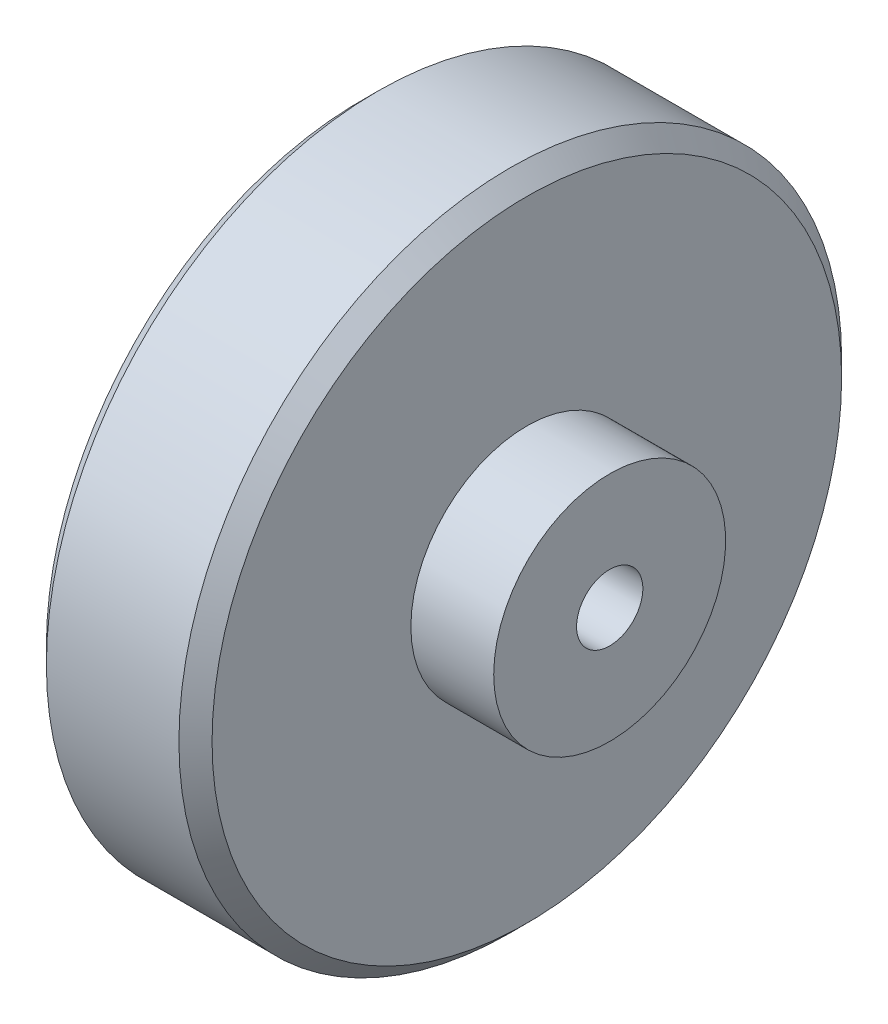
ISO-10303-21;
HEADER;
FILE_DESCRIPTION(('STEP AP214'),'2;1');
FILE_NAME('part.step','',(''),(''),'','','');
FILE_SCHEMA(('AUTOMOTIVE_DESIGN { 1 0 10303 214 1 1 1 1 }'));
ENDSEC;
DATA;
#1=APPLICATION_CONTEXT('core data for automotive mechanical design processes');
#2=APPLICATION_PROTOCOL_DEFINITION('international standard','automotive_design',2000,#1);
#3=PRODUCT_CONTEXT('',#1,'mechanical');
#4=PRODUCT('Part','Part','',(#3));
#5=PRODUCT_RELATED_PRODUCT_CATEGORY('part','',(#4));
#6=PRODUCT_DEFINITION_FORMATION('','',#4);
#7=PRODUCT_DEFINITION_CONTEXT('part definition',#1,'design');
#8=PRODUCT_DEFINITION('design','',#6,#7);
#9=PRODUCT_DEFINITION_SHAPE('','',#8);
#10=(LENGTH_UNIT() NAMED_UNIT(*) SI_UNIT(.MILLI.,.METRE.));
#11=(NAMED_UNIT(*) PLANE_ANGLE_UNIT() SI_UNIT($,.RADIAN.));
#12=(NAMED_UNIT(*) SI_UNIT($,.STERADIAN.) SOLID_ANGLE_UNIT());
#13=UNCERTAINTY_MEASURE_WITH_UNIT(LENGTH_MEASURE(1.E-05),#10,'distance_accuracy_value','');
#14=(GEOMETRIC_REPRESENTATION_CONTEXT(3) GLOBAL_UNCERTAINTY_ASSIGNED_CONTEXT((#13)) GLOBAL_UNIT_ASSIGNED_CONTEXT((#10,
#11,#12)) REPRESENTATION_CONTEXT('',''));
#15=CARTESIAN_POINT('',(0.,0.,0.));
#16=DIRECTION('',(0.,0.,1.));
#17=DIRECTION('',(1.,0.,0.));
#18=AXIS2_PLACEMENT_3D('',#15,#16,#17);
#19=CARTESIAN_POINT('',(0.,-9.58685783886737,0.));
#20=DIRECTION('',(1.,0.,0.));
#21=DIRECTION('',(0.,0.,-1.));
#22=AXIS2_PLACEMENT_3D('',#19,#20,#21);
#23=PLANE('',#22);
#24=CARTESIAN_POINT('',(0.,0.,0.));
#25=DIRECTION('',(1.,0.,0.));
#26=DIRECTION('',(0.,0.,-1.));
#27=AXIS2_PLACEMENT_3D('',#24,#25,#26);
#28=CIRCLE('',#27,19.);
#29=CARTESIAN_POINT('',(0.,0.,-19.));
#30=VERTEX_POINT('',#29);
#31=EDGE_CURVE('E10',#30,#30,#28,.F.);
#32=ORIENTED_EDGE('',*,*,#31,.T.);
#33=EDGE_LOOP('',(#32));
#34=FACE_BOUND('',#33,.T.);
#35=CARTESIAN_POINT('',(0.,0.,0.));
#36=DIRECTION('',(-1.,0.,0.));
#37=DIRECTION('',(0.,0.,1.));
#38=AXIS2_PLACEMENT_3D('',#35,#36,#37);
#39=CIRCLE('',#38,2.);
#40=CARTESIAN_POINT('',(0.,0.,2.));
#41=VERTEX_POINT('',#40);
#42=EDGE_CURVE('E49',#41,#41,#39,.T.);
#43=ORIENTED_EDGE('',*,*,#42,.F.);
#44=EDGE_LOOP('',(#43));
#45=FACE_BOUND('',#44,.T.);
#46=ADVANCED_FACE('F30',(#34,#45),#23,.F.);
#47=CARTESIAN_POINT('',(0.,0.,0.));
#48=DIRECTION('',(-1.,0.,0.));
#49=DIRECTION('',(0.,0.,1.));
#50=AXIS2_PLACEMENT_3D('',#47,#48,#49);
#51=CYLINDRICAL_SURFACE('',#50,2.);
#52=CARTESIAN_POINT('',(15.,0.,0.));
#53=DIRECTION('',(-1.,0.,0.));
#54=DIRECTION('',(0.,0.,1.));
#55=AXIS2_PLACEMENT_3D('',#52,#53,#54);
#56=CIRCLE('',#55,2.);
#57=CARTESIAN_POINT('',(15.,0.,2.));
#58=VERTEX_POINT('',#57);
#59=EDGE_CURVE('E52',#58,#58,#56,.T.);
#60=ORIENTED_EDGE('',*,*,#59,.F.);
#61=EDGE_LOOP('',(#60));
#62=FACE_BOUND('',#61,.T.);
#63=ORIENTED_EDGE('',*,*,#42,.T.);
#64=EDGE_LOOP('',(#63));
#65=FACE_BOUND('',#64,.T.);
#66=ADVANCED_FACE('F73',(#62,#65),#51,.F.);
#67=CARTESIAN_POINT('',(15.,-9.58685783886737,0.));
#68=DIRECTION('',(-1.,0.,0.));
#69=DIRECTION('',(0.,0.,1.));
#70=AXIS2_PLACEMENT_3D('',#67,#68,#69);
#71=PLANE('',#70);
#72=CARTESIAN_POINT('',(15.,0.,0.));
#73=DIRECTION('',(-1.,0.,0.));
#74=DIRECTION('',(0.,0.,1.));
#75=AXIS2_PLACEMENT_3D('',#72,#73,#74);
#76=CIRCLE('',#75,7.);
#77=CARTESIAN_POINT('',(15.,0.,7.));
#78=VERTEX_POINT('',#77);
#79=EDGE_CURVE('E55',#78,#78,#76,.T.);
#80=ORIENTED_EDGE('',*,*,#79,.F.);
#81=EDGE_LOOP('',(#80));
#82=FACE_BOUND('',#81,.T.);
#83=ORIENTED_EDGE('',*,*,#59,.T.);
#84=EDGE_LOOP('',(#83));
#85=FACE_BOUND('',#84,.T.);
#86=ADVANCED_FACE('F67',(#82,#85),#71,.F.);
#87=CARTESIAN_POINT('',(0.,0.,0.));
#88=DIRECTION('',(-1.,0.,0.));
#89=DIRECTION('',(0.,0.,1.));
#90=AXIS2_PLACEMENT_3D('',#87,#88,#89);
#91=CYLINDRICAL_SURFACE('',#90,7.);
#92=CARTESIAN_POINT('',(10.,0.,0.));
#93=DIRECTION('',(-1.,0.,0.));
#94=DIRECTION('',(0.,0.,1.));
#95=AXIS2_PLACEMENT_3D('',#92,#93,#94);
#96=CIRCLE('',#95,7.);
#97=CARTESIAN_POINT('',(10.,0.,7.));
#98=VERTEX_POINT('',#97);
#99=EDGE_CURVE('E58',#98,#98,#96,.T.);
#100=ORIENTED_EDGE('',*,*,#99,.F.);
#101=EDGE_LOOP('',(#100));
#102=FACE_BOUND('',#101,.T.);
#103=ORIENTED_EDGE('',*,*,#79,.T.);
#104=EDGE_LOOP('',(#103));
#105=FACE_BOUND('',#104,.T.);
#106=ADVANCED_FACE('F64',(#102,#105),#91,.T.);
#107=CARTESIAN_POINT('',(10.,-9.58685783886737,0.));
#108=DIRECTION('',(-1.,0.,0.));
#109=DIRECTION('',(0.,0.,1.));
#110=AXIS2_PLACEMENT_3D('',#107,#108,#109);
#111=PLANE('',#110);
#112=CARTESIAN_POINT('',(10.,0.,0.));
#113=DIRECTION('',(-1.,0.,0.));
#114=DIRECTION('',(0.,0.,1.));
#115=AXIS2_PLACEMENT_3D('',#112,#113,#114);
#116=CIRCLE('',#115,19.);
#117=CARTESIAN_POINT('',(10.,0.,19.));
#118=VERTEX_POINT('',#117);
#119=EDGE_CURVE('E36',#118,#118,#116,.F.);
#120=ORIENTED_EDGE('',*,*,#119,.T.);
#121=EDGE_LOOP('',(#120));
#122=FACE_BOUND('',#121,.T.);
#123=ORIENTED_EDGE('',*,*,#99,.T.);
#124=EDGE_LOOP('',(#123));
#125=FACE_BOUND('',#124,.T.);
#126=ADVANCED_FACE('F62',(#122,#125),#111,.F.);
#127=CARTESIAN_POINT('',(0.,0.,0.));
#128=DIRECTION('',(-1.,0.,0.));
#129=DIRECTION('',(0.,0.,1.));
#130=AXIS2_PLACEMENT_3D('',#127,#128,#129);
#131=CYLINDRICAL_SURFACE('',#130,20.);
#132=CARTESIAN_POINT('',(9.00000000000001,0.,0.));
#133=DIRECTION('',(-1.,0.,0.));
#134=DIRECTION('',(0.,0.,1.));
#135=AXIS2_PLACEMENT_3D('',#132,#133,#134);
#136=CIRCLE('',#135,20.);
#137=CARTESIAN_POINT('',(9.00000000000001,0.,20.));
#138=VERTEX_POINT('',#137);
#139=EDGE_CURVE('E40',#138,#138,#136,.T.);
#140=ORIENTED_EDGE('',*,*,#139,.T.);
#141=EDGE_LOOP('',(#140));
#142=FACE_BOUND('',#141,.T.);
#143=CARTESIAN_POINT('',(0.999999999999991,0.,0.));
#144=DIRECTION('',(1.,0.,0.));
#145=DIRECTION('',(0.,0.,-1.));
#146=AXIS2_PLACEMENT_3D('',#143,#144,#145);
#147=CIRCLE('',#146,20.);
#148=CARTESIAN_POINT('',(0.999999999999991,0.,-20.));
#149=VERTEX_POINT('',#148);
#150=EDGE_CURVE('E44',#149,#149,#147,.T.);
#151=ORIENTED_EDGE('',*,*,#150,.T.);
#152=EDGE_LOOP('',(#151));
#153=FACE_BOUND('',#152,.T.);
#154=ADVANCED_FACE('F101',(#142,#153),#131,.T.);
#155=CARTESIAN_POINT('',(9.00000000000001,0.,0.));
#156=DIRECTION('',(-1.,0.,0.));
#157=DIRECTION('',(0.,0.,1.));
#158=AXIS2_PLACEMENT_3D('',#155,#156,#157);
#159=CONICAL_SURFACE('',#158,20.,0.78539816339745);
#160=ORIENTED_EDGE('',*,*,#119,.F.);
#161=EDGE_LOOP('',(#160));
#162=FACE_BOUND('',#161,.T.);
#163=ORIENTED_EDGE('',*,*,#139,.F.);
#164=EDGE_LOOP('',(#163));
#165=FACE_BOUND('',#164,.T.);
#166=ADVANCED_FACE('F108',(#162,#165),#159,.T.);
#167=CARTESIAN_POINT('',(0.,0.,0.));
#168=DIRECTION('',(1.,0.,0.));
#169=DIRECTION('',(0.,0.,-1.));
#170=AXIS2_PLACEMENT_3D('',#167,#168,#169);
#171=CONICAL_SURFACE('',#170,19.,0.785398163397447);
#172=ORIENTED_EDGE('',*,*,#150,.F.);
#173=EDGE_LOOP('',(#172));
#174=FACE_BOUND('',#173,.T.);
#175=ORIENTED_EDGE('',*,*,#31,.F.);
#176=EDGE_LOOP('',(#175));
#177=FACE_BOUND('',#176,.T.);
#178=ADVANCED_FACE('F116',(#174,#177),#171,.T.);
#179=CLOSED_SHELL('',(#46,#66,#86,#106,#126,#154,#166,#178));
#180=MANIFOLD_SOLID_BREP('B2',#179);
#181=ADVANCED_BREP_SHAPE_REPRESENTATION('',(#18,#180),#14);
#182=SHAPE_DEFINITION_REPRESENTATION(#9,#181);
ENDSEC;
END-ISO-10303-21;
